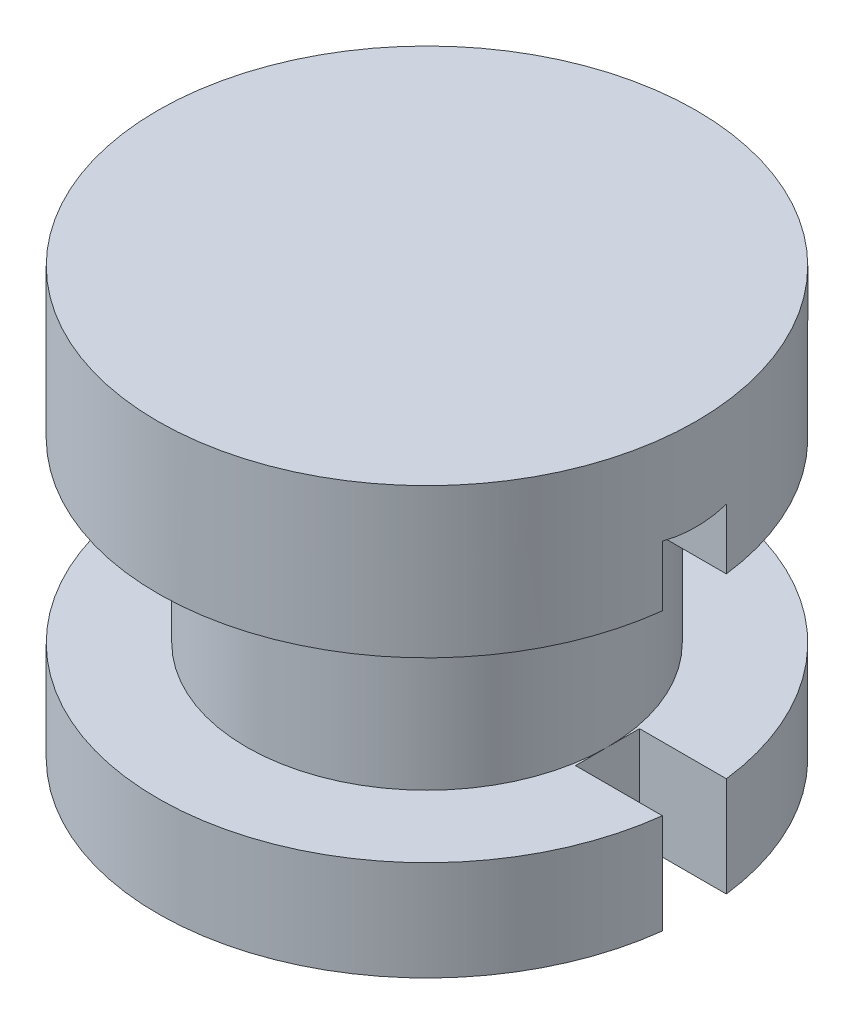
ISO-10303-21;
HEADER;
FILE_DESCRIPTION(('STEP AP214'),'2;1');
FILE_NAME('part.step','',(''),(''),'','','');
FILE_SCHEMA(('AUTOMOTIVE_DESIGN { 1 0 10303 214 1 1 1 1 }'));
ENDSEC;
DATA;
#1=APPLICATION_CONTEXT('core data for automotive mechanical design processes');
#2=APPLICATION_PROTOCOL_DEFINITION('international standard','automotive_design',2000,#1);
#3=PRODUCT_CONTEXT('',#1,'mechanical');
#4=PRODUCT('Part','Part','',(#3));
#5=PRODUCT_RELATED_PRODUCT_CATEGORY('part','',(#4));
#6=PRODUCT_DEFINITION_FORMATION('','',#4);
#7=PRODUCT_DEFINITION_CONTEXT('part definition',#1,'design');
#8=PRODUCT_DEFINITION('design','',#6,#7);
#9=PRODUCT_DEFINITION_SHAPE('','',#8);
#10=(LENGTH_UNIT() NAMED_UNIT(*) SI_UNIT(.MILLI.,.METRE.));
#11=(NAMED_UNIT(*) PLANE_ANGLE_UNIT() SI_UNIT($,.RADIAN.));
#12=(NAMED_UNIT(*) SI_UNIT($,.STERADIAN.) SOLID_ANGLE_UNIT());
#13=UNCERTAINTY_MEASURE_WITH_UNIT(LENGTH_MEASURE(1.E-05),#10,'distance_accuracy_value','');
#14=(GEOMETRIC_REPRESENTATION_CONTEXT(3) GLOBAL_UNCERTAINTY_ASSIGNED_CONTEXT((#13)) GLOBAL_UNIT_ASSIGNED_CONTEXT((#10,
#11,#12)) REPRESENTATION_CONTEXT('',''));
#15=CARTESIAN_POINT('',(0.,0.,0.));
#16=DIRECTION('',(0.,0.,1.));
#17=DIRECTION('',(1.,0.,0.));
#18=AXIS2_PLACEMENT_3D('',#15,#16,#17);
#19=CARTESIAN_POINT('',(-28.1825835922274,69.7762074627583,0.));
#20=DIRECTION('',(0.,1.,0.));
#21=DIRECTION('',(-1.,0.,0.));
#22=AXIS2_PLACEMENT_3D('',#19,#20,#21);
#23=CYLINDRICAL_SURFACE('',#22,28.1825835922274);
#24=CARTESIAN_POINT('',(-28.1825835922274,15.5921879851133,0.));
#25=DIRECTION('',(0.,1.,0.));
#26=DIRECTION('',(-1.,0.,0.));
#27=AXIS2_PLACEMENT_3D('',#24,#25,#26);
#28=CIRCLE('',#27,28.1825835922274);
#29=CARTESIAN_POINT('',(0.,15.5921879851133,0.));
#30=VERTEX_POINT('',#29);
#31=EDGE_CURVE('E155',#30,#30,#28,.T.);
#32=ORIENTED_EDGE('',*,*,#31,.T.);
#33=EDGE_LOOP('',(#32));
#34=FACE_BOUND('',#33,.T.);
#35=CARTESIAN_POINT('',(-28.1825835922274,43.2930069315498,0.));
#36=DIRECTION('',(0.,1.,0.));
#37=DIRECTION('',(-1.,0.,0.));
#38=AXIS2_PLACEMENT_3D('',#35,#36,#37);
#39=CIRCLE('',#38,28.1825835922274);
#40=CARTESIAN_POINT('',(0.,43.2930069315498,0.));
#41=VERTEX_POINT('',#40);
#42=EDGE_CURVE('E170',#41,#41,#39,.T.);
#43=ORIENTED_EDGE('',*,*,#42,.F.);
#44=EDGE_LOOP('',(#43));
#45=FACE_BOUND('',#44,.T.);
#46=ADVANCED_FACE('F35',(#34,#45),#23,.T.);
#47=CARTESIAN_POINT('',(10.6290033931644,43.2930069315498,0.));
#48=DIRECTION('',(0.,-1.,0.));
#49=DIRECTION('',(1.,0.,0.));
#50=AXIS2_PLACEMENT_3D('',#47,#48,#49);
#51=PLANE('',#50);
#52=DIRECTION('',(-1.,0.,0.));
#53=VECTOR('',#52,1.);
#54=CARTESIAN_POINT('',(10.6290033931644,43.2930069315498,5.));
#55=LINE('',#54,#53);
#56=CARTESIAN_POINT('',(13.5603538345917,43.2930069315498,5.));
#57=VERTEX_POINT('',#56);
#58=CARTESIAN_POINT('',(0.,43.2930069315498,5.));
#59=VERTEX_POINT('',#58);
#60=EDGE_CURVE('E149',#57,#59,#55,.T.);
#61=ORIENTED_EDGE('',*,*,#60,.F.);
#62=CARTESIAN_POINT('',(-28.1825835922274,43.2930069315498,0.));
#63=DIRECTION('',(0.,1.,0.));
#64=DIRECTION('',(-1.,0.,0.));
#65=AXIS2_PLACEMENT_3D('',#62,#63,#64);
#66=CIRCLE('',#65,42.0413228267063);
#67=CARTESIAN_POINT('',(13.5603538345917,43.2930069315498,-5.));
#68=VERTEX_POINT('',#67);
#69=EDGE_CURVE('E167',#68,#57,#66,.T.);
#70=ORIENTED_EDGE('',*,*,#69,.F.);
#71=DIRECTION('',(-1.,0.,0.));
#72=VECTOR('',#71,1.);
#73=CARTESIAN_POINT('',(10.6290033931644,43.2930069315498,-5.));
#74=LINE('',#73,#72);
#75=CARTESIAN_POINT('',(0.,43.2930069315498,-5.));
#76=VERTEX_POINT('',#75);
#77=EDGE_CURVE('E49',#68,#76,#74,.T.);
#78=ORIENTED_EDGE('',*,*,#77,.T.);
#79=DIRECTION('',(0.,0.,1.));
#80=VECTOR('',#79,1.);
#81=CARTESIAN_POINT('',(0.,43.2930069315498,0.));
#82=LINE('',#81,#80);
#83=EDGE_CURVE('E154',#76,#41,#82,.T.);
#84=ORIENTED_EDGE('',*,*,#83,.T.);
#85=ORIENTED_EDGE('',*,*,#42,.T.);
#86=EDGE_CURVE('E151',#41,#59,#82,.T.);
#87=ORIENTED_EDGE('',*,*,#86,.T.);
#88=EDGE_LOOP('',(#61,#70,#78,#84,#85,#87));
#89=FACE_BOUND('',#88,.T.);
#90=ADVANCED_FACE('F190',(#89),#51,.T.);
#91=CARTESIAN_POINT('',(-28.1825835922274,69.7762074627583,0.));
#92=DIRECTION('',(0.,1.,0.));
#93=DIRECTION('',(-1.,0.,0.));
#94=AXIS2_PLACEMENT_3D('',#91,#92,#93);
#95=CYLINDRICAL_SURFACE('',#94,42.0413228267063);
#96=DIRECTION('',(0.,1.,0.));
#97=VECTOR('',#96,1.);
#98=CARTESIAN_POINT('',(13.5603538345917,69.7762074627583,5.));
#99=LINE('',#98,#97);
#100=CARTESIAN_POINT('',(13.5603538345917,52.7160781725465,5.));
#101=VERTEX_POINT('',#100);
#102=EDGE_CURVE('E147',#101,#57,#99,.F.);
#103=ORIENTED_EDGE('',*,*,#102,.F.);
#104=CARTESIAN_POINT('',(-28.1825835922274,112.032821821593,0.));
#105=DIRECTION('',(-0.817796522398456,-0.575507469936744,0.));
#106=DIRECTION('',(-0.575507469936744,0.817796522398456,0.));
#107=AXIS2_PLACEMENT_3D('',#104,#105,#106);
#108=ELLIPSE('',#107,73.0508725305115,42.0413228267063);
#109=CARTESIAN_POINT('',(13.5603538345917,52.7160781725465,-5.));
#110=VERTEX_POINT('',#109);
#111=EDGE_CURVE('E11',#101,#110,#108,.F.);
#112=ORIENTED_EDGE('',*,*,#111,.T.);
#113=DIRECTION('',(0.,1.,0.));
#114=VECTOR('',#113,1.);
#115=CARTESIAN_POINT('',(13.5603538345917,69.7762074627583,-5.));
#116=LINE('',#115,#114);
#117=EDGE_CURVE('E137',#110,#68,#116,.F.);
#118=ORIENTED_EDGE('',*,*,#117,.T.);
#119=ORIENTED_EDGE('',*,*,#69,.T.);
#120=EDGE_LOOP('',(#103,#112,#118,#119));
#121=FACE_BOUND('',#120,.T.);
#122=CARTESIAN_POINT('',(-28.1825835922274,66.5799591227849,0.));
#123=DIRECTION('',(0.,1.,0.));
#124=DIRECTION('',(-1.,0.,0.));
#125=AXIS2_PLACEMENT_3D('',#122,#123,#124);
#126=CIRCLE('',#125,42.0413228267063);
#127=CARTESIAN_POINT('',(-70.2239064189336,66.5799591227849,0.));
#128=VERTEX_POINT('',#127);
#129=EDGE_CURVE('E164',#128,#128,#126,.T.);
#130=ORIENTED_EDGE('',*,*,#129,.F.);
#131=EDGE_LOOP('',(#130));
#132=FACE_BOUND('',#131,.T.);
#133=ADVANCED_FACE('F219',(#121,#132),#95,.T.);
#134=CARTESIAN_POINT('',(10.6290033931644,66.5799591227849,0.));
#135=DIRECTION('',(0.,1.,0.));
#136=DIRECTION('',(-1.,0.,0.));
#137=AXIS2_PLACEMENT_3D('',#134,#135,#136);
#138=PLANE('',#137);
#139=ORIENTED_EDGE('',*,*,#129,.T.);
#140=EDGE_LOOP('',(#139));
#141=FACE_BOUND('',#140,.T.);
#142=ADVANCED_FACE('F222',(#141),#138,.T.);
#143=CARTESIAN_POINT('',(10.6290033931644,0.,0.));
#144=DIRECTION('',(0.,-1.,0.));
#145=DIRECTION('',(1.,0.,0.));
#146=AXIS2_PLACEMENT_3D('',#143,#144,#145);
#147=PLANE('',#146);
#148=DIRECTION('',(1.,0.,0.));
#149=VECTOR('',#148,1.);
#150=CARTESIAN_POINT('',(0.,0.,5.));
#151=LINE('',#150,#149);
#152=CARTESIAN_POINT('',(0.,0.,5.));
#153=VERTEX_POINT('',#152);
#154=CARTESIAN_POINT('',(13.5603538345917,0.,5.));
#155=VERTEX_POINT('',#154);
#156=EDGE_CURVE('E207',#153,#155,#151,.T.);
#157=ORIENTED_EDGE('',*,*,#156,.T.);
#158=CARTESIAN_POINT('',(-28.1825835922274,0.,0.));
#159=DIRECTION('',(0.,1.,0.));
#160=DIRECTION('',(-1.,0.,0.));
#161=AXIS2_PLACEMENT_3D('',#158,#159,#160);
#162=CIRCLE('',#161,42.0413228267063);
#163=CARTESIAN_POINT('',(13.5603538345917,0.,-5.));
#164=VERTEX_POINT('',#163);
#165=EDGE_CURVE('E161',#164,#155,#162,.T.);
#166=ORIENTED_EDGE('',*,*,#165,.F.);
#167=DIRECTION('',(1.,0.,0.));
#168=VECTOR('',#167,1.);
#169=CARTESIAN_POINT('',(0.,0.,-5.));
#170=LINE('',#169,#168);
#171=CARTESIAN_POINT('',(0.,0.,-5.));
#172=VERTEX_POINT('',#171);
#173=EDGE_CURVE('E121',#172,#164,#170,.T.);
#174=ORIENTED_EDGE('',*,*,#173,.F.);
#175=DIRECTION('',(0.,0.,-1.));
#176=VECTOR('',#175,1.);
#177=CARTESIAN_POINT('',(0.,0.,5.));
#178=LINE('',#177,#176);
#179=EDGE_CURVE('E139',#153,#172,#178,.T.);
#180=ORIENTED_EDGE('',*,*,#179,.F.);
#181=EDGE_LOOP('',(#157,#166,#174,#180));
#182=FACE_BOUND('',#181,.T.);
#183=ADVANCED_FACE('F227',(#182),#147,.T.);
#184=CARTESIAN_POINT('',(-28.1825835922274,69.7762074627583,0.));
#185=DIRECTION('',(0.,1.,0.));
#186=DIRECTION('',(-1.,0.,0.));
#187=AXIS2_PLACEMENT_3D('',#184,#185,#186);
#188=CYLINDRICAL_SURFACE('',#187,42.0413228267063);
#189=DIRECTION('',(0.,1.,0.));
#190=VECTOR('',#189,1.);
#191=CARTESIAN_POINT('',(13.5603538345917,69.7762074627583,5.));
#192=LINE('',#191,#190);
#193=CARTESIAN_POINT('',(13.5603538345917,15.5921879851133,5.));
#194=VERTEX_POINT('',#193);
#195=EDGE_CURVE('E145',#194,#155,#192,.F.);
#196=ORIENTED_EDGE('',*,*,#195,.F.);
#197=CARTESIAN_POINT('',(-28.1825835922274,15.5921879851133,0.));
#198=DIRECTION('',(0.,1.,0.));
#199=DIRECTION('',(-1.,0.,0.));
#200=AXIS2_PLACEMENT_3D('',#197,#198,#199);
#201=CIRCLE('',#200,42.0413228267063);
#202=CARTESIAN_POINT('',(13.5603538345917,15.5921879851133,-5.));
#203=VERTEX_POINT('',#202);
#204=EDGE_CURVE('E158',#203,#194,#201,.T.);
#205=ORIENTED_EDGE('',*,*,#204,.F.);
#206=DIRECTION('',(0.,1.,0.));
#207=VECTOR('',#206,1.);
#208=CARTESIAN_POINT('',(13.5603538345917,69.7762074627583,-5.));
#209=LINE('',#208,#207);
#210=EDGE_CURVE('E57',#203,#164,#209,.F.);
#211=ORIENTED_EDGE('',*,*,#210,.T.);
#212=ORIENTED_EDGE('',*,*,#165,.T.);
#213=EDGE_LOOP('',(#196,#205,#211,#212));
#214=FACE_BOUND('',#213,.T.);
#215=ADVANCED_FACE('F232',(#214),#188,.T.);
#216=CARTESIAN_POINT('',(10.6290033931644,15.5921879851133,0.));
#217=DIRECTION('',(0.,1.,0.));
#218=DIRECTION('',(-1.,0.,0.));
#219=AXIS2_PLACEMENT_3D('',#216,#217,#218);
#220=PLANE('',#219);
#221=DIRECTION('',(1.,0.,0.));
#222=VECTOR('',#221,1.);
#223=CARTESIAN_POINT('',(10.6290033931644,15.5921879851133,5.));
#224=LINE('',#223,#222);
#225=CARTESIAN_POINT('',(0.,15.5921879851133,5.));
#226=VERTEX_POINT('',#225);
#227=EDGE_CURVE('E42',#226,#194,#224,.T.);
#228=ORIENTED_EDGE('',*,*,#227,.F.);
#229=DIRECTION('',(0.,0.,-1.));
#230=VECTOR('',#229,1.);
#231=CARTESIAN_POINT('',(0.,15.5921879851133,0.));
#232=LINE('',#231,#230);
#233=EDGE_CURVE('E177',#226,#30,#232,.T.);
#234=ORIENTED_EDGE('',*,*,#233,.T.);
#235=ORIENTED_EDGE('',*,*,#31,.F.);
#236=CARTESIAN_POINT('',(0.,15.5921879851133,-5.));
#237=VERTEX_POINT('',#236);
#238=EDGE_CURVE('E175',#30,#237,#232,.T.);
#239=ORIENTED_EDGE('',*,*,#238,.T.);
#240=DIRECTION('',(1.,0.,0.));
#241=VECTOR('',#240,1.);
#242=CARTESIAN_POINT('',(10.6290033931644,15.5921879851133,-5.));
#243=LINE('',#242,#241);
#244=EDGE_CURVE('E173',#237,#203,#243,.T.);
#245=ORIENTED_EDGE('',*,*,#244,.T.);
#246=ORIENTED_EDGE('',*,*,#204,.T.);
#247=EDGE_LOOP('',(#228,#234,#235,#239,#245,#246));
#248=FACE_BOUND('',#247,.T.);
#249=ADVANCED_FACE('F185',(#248),#220,.T.);
#250=CARTESIAN_POINT('',(10.8651174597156,56.5460109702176,-5.));
#251=DIRECTION('',(0.,0.,1.));
#252=DIRECTION('',(1.,0.,0.));
#253=AXIS2_PLACEMENT_3D('',#250,#251,#252);
#254=PLANE('',#253);
#255=ORIENTED_EDGE('',*,*,#244,.F.);
#256=DIRECTION('',(0.,-1.,0.));
#257=VECTOR('',#256,1.);
#258=CARTESIAN_POINT('',(0.,56.5460109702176,-5.));
#259=LINE('',#258,#257);
#260=EDGE_CURVE('E201',#237,#172,#259,.T.);
#261=ORIENTED_EDGE('',*,*,#260,.T.);
#262=ORIENTED_EDGE('',*,*,#173,.T.);
#263=ORIENTED_EDGE('',*,*,#210,.F.);
#264=EDGE_LOOP('',(#255,#261,#262,#263));
#265=FACE_BOUND('',#264,.T.);
#266=ADVANCED_FACE('F262',(#265),#254,.T.);
#267=CARTESIAN_POINT('',(10.8651174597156,56.5460109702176,5.));
#268=DIRECTION('',(0.,0.,1.));
#269=DIRECTION('',(1.,0.,0.));
#270=AXIS2_PLACEMENT_3D('',#267,#268,#269);
#271=PLANE('',#270);
#272=ORIENTED_EDGE('',*,*,#195,.T.);
#273=ORIENTED_EDGE('',*,*,#156,.F.);
#274=DIRECTION('',(0.,-1.,0.));
#275=VECTOR('',#274,1.);
#276=CARTESIAN_POINT('',(0.,56.5460109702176,5.));
#277=LINE('',#276,#275);
#278=EDGE_CURVE('E130',#226,#153,#277,.T.);
#279=ORIENTED_EDGE('',*,*,#278,.F.);
#280=ORIENTED_EDGE('',*,*,#227,.T.);
#281=EDGE_LOOP('',(#272,#273,#279,#280));
#282=FACE_BOUND('',#281,.T.);
#283=ADVANCED_FACE('F270',(#282),#271,.F.);
#284=CARTESIAN_POINT('',(0.,56.5460109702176,5.));
#285=DIRECTION('',(1.,0.,0.));
#286=DIRECTION('',(0.,0.,-1.));
#287=AXIS2_PLACEMENT_3D('',#284,#285,#286);
#288=PLANE('',#287);
#289=ORIENTED_EDGE('',*,*,#278,.T.);
#290=ORIENTED_EDGE('',*,*,#179,.T.);
#291=ORIENTED_EDGE('',*,*,#260,.F.);
#292=ORIENTED_EDGE('',*,*,#238,.F.);
#293=ORIENTED_EDGE('',*,*,#233,.F.);
#294=EDGE_LOOP('',(#289,#290,#291,#292,#293));
#295=FACE_BOUND('',#294,.T.);
#296=ADVANCED_FACE('F278',(#295),#288,.T.);
#297=CARTESIAN_POINT('',(0.,56.5460109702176,-5.));
#298=VERTEX_POINT('',#297);
#299=EDGE_CURVE('E199',#298,#76,#259,.T.);
#300=ORIENTED_EDGE('',*,*,#299,.F.);
#301=DIRECTION('',(0.,0.,-1.));
#302=VECTOR('',#301,1.);
#303=CARTESIAN_POINT('',(0.,56.5460109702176,5.));
#304=LINE('',#303,#302);
#305=CARTESIAN_POINT('',(0.,56.5460109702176,5.));
#306=VERTEX_POINT('',#305);
#307=EDGE_CURVE('E135',#306,#298,#304,.T.);
#308=ORIENTED_EDGE('',*,*,#307,.F.);
#309=EDGE_CURVE('E126',#306,#59,#277,.T.);
#310=ORIENTED_EDGE('',*,*,#309,.T.);
#311=ORIENTED_EDGE('',*,*,#86,.F.);
#312=ORIENTED_EDGE('',*,*,#83,.F.);
#313=EDGE_LOOP('',(#300,#308,#310,#311,#312));
#314=FACE_BOUND('',#313,.T.);
#315=ADVANCED_FACE('F198',(#314),#288,.T.);
#316=ORIENTED_EDGE('',*,*,#60,.T.);
#317=ORIENTED_EDGE('',*,*,#309,.F.);
#318=DIRECTION('',(-1.,0.,0.));
#319=VECTOR('',#318,1.);
#320=CARTESIAN_POINT('',(10.8651174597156,56.5460109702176,5.));
#321=LINE('',#320,#319);
#322=CARTESIAN_POINT('',(10.8651174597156,56.5460109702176,5.));
#323=VERTEX_POINT('',#322);
#324=EDGE_CURVE('E120',#323,#306,#321,.T.);
#325=ORIENTED_EDGE('',*,*,#324,.F.);
#326=DIRECTION('',(-0.575507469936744,0.817796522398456,0.));
#327=VECTOR('',#326,1.);
#328=CARTESIAN_POINT('',(50.6582087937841,0.,5.));
#329=LINE('',#328,#327);
#330=EDGE_CURVE('E112',#101,#323,#329,.T.);
#331=ORIENTED_EDGE('',*,*,#330,.F.);
#332=ORIENTED_EDGE('',*,*,#102,.T.);
#333=EDGE_LOOP('',(#316,#317,#325,#331,#332));
#334=FACE_BOUND('',#333,.T.);
#335=ADVANCED_FACE('F124',(#334),#271,.F.);
#336=ORIENTED_EDGE('',*,*,#117,.F.);
#337=DIRECTION('',(-0.575507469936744,0.817796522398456,0.));
#338=VECTOR('',#337,1.);
#339=CARTESIAN_POINT('',(50.6582087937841,0.,-5.));
#340=LINE('',#339,#338);
#341=CARTESIAN_POINT('',(10.8651174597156,56.5460109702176,-5.));
#342=VERTEX_POINT('',#341);
#343=EDGE_CURVE('E217',#110,#342,#340,.T.);
#344=ORIENTED_EDGE('',*,*,#343,.T.);
#345=DIRECTION('',(-1.,0.,0.));
#346=VECTOR('',#345,1.);
#347=CARTESIAN_POINT('',(10.8651174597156,56.5460109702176,-5.));
#348=LINE('',#347,#346);
#349=EDGE_CURVE('E134',#342,#298,#348,.T.);
#350=ORIENTED_EDGE('',*,*,#349,.T.);
#351=ORIENTED_EDGE('',*,*,#299,.T.);
#352=ORIENTED_EDGE('',*,*,#77,.F.);
#353=EDGE_LOOP('',(#336,#344,#350,#351,#352));
#354=FACE_BOUND('',#353,.T.);
#355=ADVANCED_FACE('F200',(#354),#254,.T.);
#356=CARTESIAN_POINT('',(50.6582087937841,0.,5.));
#357=DIRECTION('',(-0.817796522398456,-0.575507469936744,0.));
#358=DIRECTION('',(0.575507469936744,-0.817796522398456,0.));
#359=AXIS2_PLACEMENT_3D('',#356,#357,#358);
#360=PLANE('',#359);
#361=ORIENTED_EDGE('',*,*,#330,.T.);
#362=DIRECTION('',(0.,0.,-1.));
#363=VECTOR('',#362,1.);
#364=CARTESIAN_POINT('',(10.8651174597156,56.5460109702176,5.));
#365=LINE('',#364,#363);
#366=EDGE_CURVE('E117',#323,#342,#365,.T.);
#367=ORIENTED_EDGE('',*,*,#366,.T.);
#368=ORIENTED_EDGE('',*,*,#343,.F.);
#369=ORIENTED_EDGE('',*,*,#111,.F.);
#370=EDGE_LOOP('',(#361,#367,#368,#369));
#371=FACE_BOUND('',#370,.T.);
#372=ADVANCED_FACE('F114',(#371),#360,.T.);
#373=CARTESIAN_POINT('',(10.8651174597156,56.5460109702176,5.));
#374=DIRECTION('',(0.,-1.,0.));
#375=DIRECTION('',(0.,0.,-1.));
#376=AXIS2_PLACEMENT_3D('',#373,#374,#375);
#377=PLANE('',#376);
#378=ORIENTED_EDGE('',*,*,#349,.F.);
#379=ORIENTED_EDGE('',*,*,#366,.F.);
#380=ORIENTED_EDGE('',*,*,#324,.T.);
#381=ORIENTED_EDGE('',*,*,#307,.T.);
#382=EDGE_LOOP('',(#378,#379,#380,#381));
#383=FACE_BOUND('',#382,.T.);
#384=ADVANCED_FACE('F133',(#383),#377,.T.);
#385=CLOSED_SHELL('',(#46,#90,#133,#142,#183,#215,#249,#266,#283,#296,#315,#335,#355,#372,#384));
#386=MANIFOLD_SOLID_BREP('B2',#385);
#387=ADVANCED_BREP_SHAPE_REPRESENTATION('',(#18,#386),#14);
#388=SHAPE_DEFINITION_REPRESENTATION(#9,#387);
ENDSEC;
END-ISO-10303-21;
